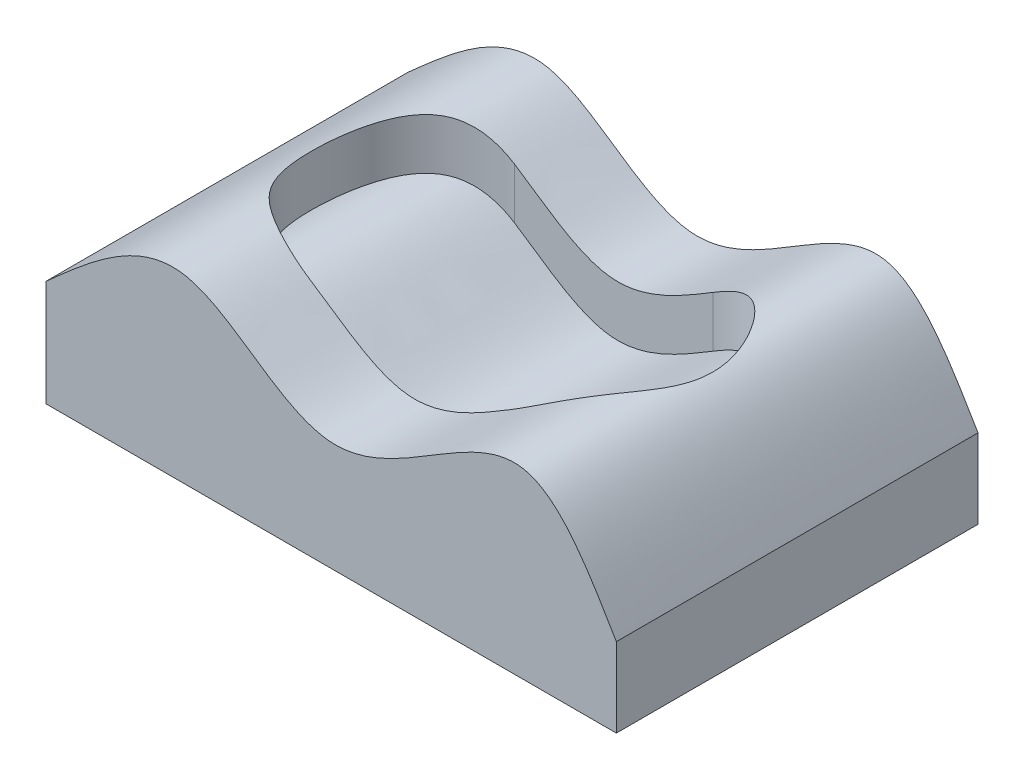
ISO-10303-21;
HEADER;
FILE_DESCRIPTION(('STEP AP214'),'2;1');
FILE_NAME('part.step','',(''),(''),'','','');
FILE_SCHEMA(('AUTOMOTIVE_DESIGN { 1 0 10303 214 1 1 1 1 }'));
ENDSEC;
DATA;
#1=APPLICATION_CONTEXT('core data for automotive mechanical design processes');
#2=APPLICATION_PROTOCOL_DEFINITION('international standard','automotive_design',2000,#1);
#3=PRODUCT_CONTEXT('',#1,'mechanical');
#4=PRODUCT('Part','Part','',(#3));
#5=PRODUCT_RELATED_PRODUCT_CATEGORY('part','',(#4));
#6=PRODUCT_DEFINITION_FORMATION('','',#4);
#7=PRODUCT_DEFINITION_CONTEXT('part definition',#1,'design');
#8=PRODUCT_DEFINITION('design','',#6,#7);
#9=PRODUCT_DEFINITION_SHAPE('','',#8);
#10=(LENGTH_UNIT() NAMED_UNIT(*) SI_UNIT(.MILLI.,.METRE.));
#11=(NAMED_UNIT(*) PLANE_ANGLE_UNIT() SI_UNIT($,.RADIAN.));
#12=(NAMED_UNIT(*) SI_UNIT($,.STERADIAN.) SOLID_ANGLE_UNIT());
#13=UNCERTAINTY_MEASURE_WITH_UNIT(LENGTH_MEASURE(1.E-05),#10,'distance_accuracy_value','');
#14=(GEOMETRIC_REPRESENTATION_CONTEXT(3) GLOBAL_UNCERTAINTY_ASSIGNED_CONTEXT((#13)) GLOBAL_UNIT_ASSIGNED_CONTEXT((#10,
#11,#12)) REPRESENTATION_CONTEXT('',''));
#15=CARTESIAN_POINT('',(0.,0.,0.));
#16=DIRECTION('',(0.,0.,1.));
#17=DIRECTION('',(1.,0.,0.));
#18=AXIS2_PLACEMENT_3D('',#15,#16,#17);
#19=CARTESIAN_POINT('',(55.9861591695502,0.,35.5));
#20=DIRECTION('',(-1.,0.,0.));
#21=DIRECTION('',(0.,0.,1.));
#22=AXIS2_PLACEMENT_3D('',#19,#20,#21);
#23=PLANE('',#22);
#24=DIRECTION('',(0.,1.,0.));
#25=VECTOR('',#24,1.);
#26=CARTESIAN_POINT('',(55.9861591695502,0.,-35.5));
#27=LINE('',#26,#25);
#28=CARTESIAN_POINT('',(55.9861591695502,0.,-35.5));
#29=VERTEX_POINT('',#28);
#30=CARTESIAN_POINT('',(55.9861591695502,15.5517108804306,-35.5));
#31=VERTEX_POINT('',#30);
#32=EDGE_CURVE('E119',#29,#31,#27,.T.);
#33=ORIENTED_EDGE('',*,*,#32,.T.);
#34=DIRECTION('',(0.,0.,-1.));
#35=VECTOR('',#34,1.);
#36=CARTESIAN_POINT('',(55.9861591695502,15.5517108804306,35.5));
#37=LINE('',#36,#35);
#38=CARTESIAN_POINT('',(55.9861591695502,15.5517108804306,35.5));
#39=VERTEX_POINT('',#38);
#40=EDGE_CURVE('E11',#39,#31,#37,.T.);
#41=ORIENTED_EDGE('',*,*,#40,.F.);
#42=DIRECTION('',(0.,1.,0.));
#43=VECTOR('',#42,1.);
#44=CARTESIAN_POINT('',(55.9861591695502,0.,35.5));
#45=LINE('',#44,#43);
#46=CARTESIAN_POINT('',(55.9861591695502,0.,35.5));
#47=VERTEX_POINT('',#46);
#48=EDGE_CURVE('E164',#47,#39,#45,.T.);
#49=ORIENTED_EDGE('',*,*,#48,.F.);
#50=DIRECTION('',(0.,0.,-1.));
#51=VECTOR('',#50,1.);
#52=CARTESIAN_POINT('',(55.9861591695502,0.,35.5));
#53=LINE('',#52,#51);
#54=EDGE_CURVE('E171',#47,#29,#53,.T.);
#55=ORIENTED_EDGE('',*,*,#54,.T.);
#56=EDGE_LOOP('',(#33,#41,#49,#55));
#57=FACE_BOUND('',#56,.T.);
#58=ADVANCED_FACE('F34',(#57),#23,.F.);
#59=CARTESIAN_POINT('',(55.9861591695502,15.5517108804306,35.5));
#60=CARTESIAN_POINT('',(50.3042531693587,25.2107971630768,35.5));
#61=CARTESIAN_POINT('',(36.3909910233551,48.8629659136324,35.5));
#62=CARTESIAN_POINT('',(1.40554862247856,7.26706724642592,35.5));
#63=CARTESIAN_POINT('',(-28.4752897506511,45.4255632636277,35.5));
#64=CARTESIAN_POINT('',(-46.9508395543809,28.9140942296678,35.5));
#65=CARTESIAN_POINT('',(-55.9861591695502,20.839292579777,35.5));
#66=B_SPLINE_CURVE_WITH_KNOTS('',3,(#59,#60,#61,#62,#63,#64,#65),.UNSPECIFIED.,.F.,.F.,(4,1,1,1,
4),(0.,0.211458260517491,0.517797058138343,0.76418251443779,1.),.UNSPECIFIED.);
#67=DIRECTION('',(0.,0.,-1.));
#68=VECTOR('',#67,1.);
#69=SURFACE_OF_LINEAR_EXTRUSION('',#66,#68);
#70=CARTESIAN_POINT('',(-19.467914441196,31.314818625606,-19.948603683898));
#71=CARTESIAN_POINT('',(-13.1813858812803,27.2886813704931,-19.948603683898));
#72=CARTESIAN_POINT('',(-0.78766788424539,16.8135515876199,-19.948603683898));
#73=CARTESIAN_POINT('',(13.0418750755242,25.0555855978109,-19.948603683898));
#74=CARTESIAN_POINT('',(19.4679144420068,28.9487308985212,-19.948603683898));
#75=B_SPLINE_CURVE_WITH_KNOTS('',3,(#70,#71,#72,#73,#74),.UNSPECIFIED.,.F.,.F.,(4,1,4),
(0.364379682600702,0.528159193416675,0.681576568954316),.UNSPECIFIED.);
#76=CARTESIAN_POINT('',(19.4679144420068,28.9487308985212,-19.948603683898));
#77=VERTEX_POINT('',#76);
#78=CARTESIAN_POINT('',(-19.4679144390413,31.314818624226,-19.948603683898));
#79=VERTEX_POINT('',#78);
#80=EDGE_CURVE('E109',#77,#79,#75,.F.);
#81=ORIENTED_EDGE('',*,*,#80,.F.);
#82=CARTESIAN_POINT('',(19.4679144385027,28.9487308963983,-19.948603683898));
#83=CARTESIAN_POINT('',(19.6837834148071,29.0795118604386,-19.9486025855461));
#84=CARTESIAN_POINT('',(19.8996219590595,29.2103505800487,-19.9452433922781));
#85=CARTESIAN_POINT('',(20.3298763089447,29.4710018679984,-19.9317204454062));
#86=CARTESIAN_POINT('',(20.5442926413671,29.600815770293,-19.9215989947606));
#87=CARTESIAN_POINT('',(20.971666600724,29.859088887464,-19.8945515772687));
#88=CARTESIAN_POINT('',(21.1846249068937,29.9875514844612,-19.8776688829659));
#89=CARTESIAN_POINT('',(21.6090443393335,30.2427973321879,-19.8370978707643));
#90=CARTESIAN_POINT('',(21.8205063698,30.3695860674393,-19.8134535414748));
#91=CARTESIAN_POINT('',(22.2419016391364,30.6211706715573,-19.759357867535));
#92=CARTESIAN_POINT('',(22.4518360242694,30.7459740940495,-19.7289509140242));
#93=CARTESIAN_POINT('',(22.7660532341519,30.931741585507,-19.6781561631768));
#94=CARTESIAN_POINT('',(22.8704296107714,30.9932791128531,-19.660409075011));
#95=CARTESIAN_POINT('',(23.0815012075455,31.117337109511,-19.6227340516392));
#96=CARTESIAN_POINT('',(23.1881948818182,31.1798478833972,-19.6027655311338));
#97=CARTESIAN_POINT('',(23.507804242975,31.3664456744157,-19.5401658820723));
#98=CARTESIAN_POINT('',(23.7206091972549,31.4898118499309,-19.4947825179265));
#99=CARTESIAN_POINT('',(24.1453827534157,31.7339730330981,-19.3967312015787));
#100=CARTESIAN_POINT('',(24.3573521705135,31.8547729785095,-19.344079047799));
#101=CARTESIAN_POINT('',(24.7804122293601,32.0934528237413,-19.2314926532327));
#102=CARTESIAN_POINT('',(24.99150378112,32.2113381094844,-19.1715732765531));
#103=CARTESIAN_POINT('',(25.4127563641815,32.4438338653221,-19.0444431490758));
#104=CARTESIAN_POINT('',(25.6229183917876,32.5584499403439,-18.977245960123));
#105=CARTESIAN_POINT('',(26.0422745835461,32.7840596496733,-18.8356002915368));
#106=CARTESIAN_POINT('',(26.2514697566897,32.8950587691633,-18.7611635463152));
#107=CARTESIAN_POINT('',(26.6742639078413,33.115911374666,-18.6028523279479));
#108=CARTESIAN_POINT('',(26.8878431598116,33.2256678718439,-18.5187893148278));
#109=CARTESIAN_POINT('',(27.3115616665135,33.4394439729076,-18.3434082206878));
#110=CARTESIAN_POINT('',(27.5217129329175,33.5435133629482,-18.2521800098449));
#111=CARTESIAN_POINT('',(27.9385754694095,33.7457029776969,-18.06251320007));
#112=CARTESIAN_POINT('',(28.1453000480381,33.8438726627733,-17.9641567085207));
#113=CARTESIAN_POINT('',(28.5552953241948,34.0340647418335,-17.7602341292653));
#114=CARTESIAN_POINT('',(28.7585803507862,34.1261346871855,-17.6547412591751));
#115=CARTESIAN_POINT('',(29.1616958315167,34.3039557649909,-17.4365463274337));
#116=CARTESIAN_POINT('',(29.3615408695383,34.3897506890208,-17.3239071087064));
#117=CARTESIAN_POINT('',(29.6591687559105,34.5137799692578,-17.149307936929));
#118=CARTESIAN_POINT('',(29.7577771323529,34.5542503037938,-17.0903228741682));
#119=CARTESIAN_POINT('',(29.9576252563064,34.6349735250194,-16.9683980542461));
#120=CARTESIAN_POINT('',(30.0588451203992,34.6751756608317,-16.9053920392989));
#121=CARTESIAN_POINT('',(30.3607169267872,34.7929779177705,-16.7136290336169));
#122=CARTESIAN_POINT('',(30.5603306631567,34.8680869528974,-16.581688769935));
#123=CARTESIAN_POINT('',(31.0050225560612,35.0288846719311,-16.276024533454));
#124=CARTESIAN_POINT('',(31.2492255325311,35.1126408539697,-16.0999973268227));
#125=CARTESIAN_POINT('',(31.6365479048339,35.2379089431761,-15.80745898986));
#126=CARTESIAN_POINT('',(31.7815039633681,35.2830419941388,-15.6948946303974));
#127=CARTESIAN_POINT('',(32.1144314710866,35.3825897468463,-15.4289455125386));
#128=CARTESIAN_POINT('',(32.3015434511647,35.4354395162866,-15.2738877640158));
#129=CARTESIAN_POINT('',(32.6686592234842,35.5329125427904,-14.957993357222));
#130=CARTESIAN_POINT('',(32.8487235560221,35.5776330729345,-14.7972569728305));
#131=CARTESIAN_POINT('',(33.2058607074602,35.660135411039,-14.4663771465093));
#132=CARTESIAN_POINT('',(33.3828707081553,35.6978264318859,-14.2961432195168));
#133=CARTESIAN_POINT('',(33.7304749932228,35.7655448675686,-13.9491557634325));
#134=CARTESIAN_POINT('',(33.9010918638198,35.7956019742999,-13.7724306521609));
#135=CARTESIAN_POINT('',(34.1941592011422,35.8418088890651,-13.4574429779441));
#136=CARTESIAN_POINT('',(34.3179511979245,35.8595558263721,-13.3206591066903));
#137=CARTESIAN_POINT('',(34.481657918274,35.8807134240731,-13.1347230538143));
#138=CARTESIAN_POINT('',(34.5231523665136,35.8858719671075,-13.0871481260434));
#139=CARTESIAN_POINT('',(34.7284720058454,35.9103908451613,-12.8494964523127));
#140=CARTESIAN_POINT('',(34.8891681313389,35.9263701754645,-12.6563316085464));
#141=CARTESIAN_POINT('',(35.2020003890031,35.9514029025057,-12.2654718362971));
#142=CARTESIAN_POINT('',(35.3541977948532,35.9605141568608,-12.06782953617));
#143=CARTESIAN_POINT('',(35.5764929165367,35.9695272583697,-11.7675563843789));
#144=CARTESIAN_POINT('',(35.6494227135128,35.9717561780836,-11.6670768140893));
#145=CARTESIAN_POINT('',(35.794769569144,35.9747848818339,-11.462849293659));
#146=CARTESIAN_POINT('',(35.8671508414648,35.9755568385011,-11.3590754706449));
#147=CARTESIAN_POINT('',(36.0804449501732,35.975719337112,-11.0470385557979));
#148=CARTESIAN_POINT('',(36.2184571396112,35.9729932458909,-10.8367779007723));
#149=CARTESIAN_POINT('',(36.4854657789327,35.9625875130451,-10.4126684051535));
#150=CARTESIAN_POINT('',(36.6145154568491,35.9549405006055,-10.198852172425));
#151=CARTESIAN_POINT('',(36.8637877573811,35.9355048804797,-9.76763895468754));
#152=CARTESIAN_POINT('',(36.9840483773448,35.9237355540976,-9.55026305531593));
#153=CARTESIAN_POINT('',(37.2159049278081,35.8968334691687,-9.11194044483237));
#154=CARTESIAN_POINT('',(37.3275245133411,35.8817103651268,-8.89100563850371));
#155=CARTESIAN_POINT('',(37.5422779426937,35.8489164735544,-8.44557725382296));
#156=CARTESIAN_POINT('',(37.6454220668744,35.831248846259,-8.22108839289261));
#157=CARTESIAN_POINT('',(37.8452520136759,35.7938610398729,-7.76423170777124));
#158=CARTESIAN_POINT('',(37.9417750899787,35.7741078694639,-7.53179541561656));
#159=CARTESIAN_POINT('',(38.1253183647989,35.7338485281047,-7.06506808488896));
#160=CARTESIAN_POINT('',(38.2123977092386,35.7133482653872,-6.8307997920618));
#161=CARTESIAN_POINT('',(38.3772206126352,35.6723788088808,-6.36041661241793));
#162=CARTESIAN_POINT('',(38.4550116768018,35.6519100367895,-6.12431833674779));
#163=CARTESIAN_POINT('',(38.6013983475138,35.6116914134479,-5.65028163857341));
#164=CARTESIAN_POINT('',(38.6700298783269,35.5919389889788,-5.41235452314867));
#165=CARTESIAN_POINT('',(38.7982172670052,35.5537530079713,-4.93465498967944));
#166=CARTESIAN_POINT('',(38.857797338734,35.5353160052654,-4.69488936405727));
#167=CARTESIAN_POINT('',(38.9404813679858,35.5090189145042,-4.33377735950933));
#168=CARTESIAN_POINT('',(38.9669149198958,35.5004841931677,-4.21323335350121));
#169=CARTESIAN_POINT('',(39.0177088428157,35.4838755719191,-3.97082248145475));
#170=CARTESIAN_POINT('',(39.0420539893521,35.4758051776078,-3.84895218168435));
#171=CARTESIAN_POINT('',(39.1116452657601,35.4524772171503,-3.48254242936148));
#172=CARTESIAN_POINT('',(39.1534297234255,35.4381085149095,-3.23728041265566));
#173=CARTESIAN_POINT('',(39.2278865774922,35.4120938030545,-2.7447978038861));
#174=CARTESIAN_POINT('',(39.260543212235,35.4004525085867,-2.49757457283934));
#175=CARTESIAN_POINT('',(39.2956613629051,35.3877926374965,-2.18773227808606));
#176=CARTESIAN_POINT('',(39.302408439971,35.3853521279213,-2.12563811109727));
#177=CARTESIAN_POINT('',(39.3283775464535,35.3759316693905,-1.87593026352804));
#178=CARTESIAN_POINT('',(39.3452796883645,35.3697361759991,-1.68803885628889));
#179=CARTESIAN_POINT('',(39.3784449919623,35.3575151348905,-1.25045650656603));
#180=CARTESIAN_POINT('',(39.3927027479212,35.3522037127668,-1.00059146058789));
#181=CARTESIAN_POINT('',(39.4116795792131,35.3451189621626,-0.501642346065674));
#182=CARTESIAN_POINT('',(39.4164437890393,35.3433288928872,-0.252560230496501));
#183=CARTESIAN_POINT('',(39.4165913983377,35.3432734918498,0.24408738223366));
#184=CARTESIAN_POINT('',(39.412031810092,35.3449867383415,0.491652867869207));
#185=CARTESIAN_POINT('',(39.3937439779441,35.3518156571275,0.986208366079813));
#186=CARTESIAN_POINT('',(39.3800227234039,35.3569287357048,1.23319867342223));
#187=CARTESIAN_POINT('',(39.3433671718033,35.3704453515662,1.72660365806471));
#188=CARTESIAN_POINT('',(39.3204255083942,35.3788515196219,1.97301771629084));
#189=CARTESIAN_POINT('',(39.2653166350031,35.3987436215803,2.46526921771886));
#190=CARTESIAN_POINT('',(39.2331279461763,35.4102367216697,2.71110395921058));
#191=CARTESIAN_POINT('',(39.159477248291,35.4360176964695,3.20220637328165));
#192=CARTESIAN_POINT('',(39.1179800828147,35.4503161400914,3.44746823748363));
#193=CARTESIAN_POINT('',(39.0488480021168,35.4735426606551,3.81441692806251));
#194=CARTESIAN_POINT('',(39.02460345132,35.4815983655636,3.93680808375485));
#195=CARTESIAN_POINT('',(38.9739571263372,35.4981987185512,4.18046671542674));
#196=CARTESIAN_POINT('',(38.9475667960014,35.5067407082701,4.30173674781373));
#197=CARTESIAN_POINT('',(38.8647796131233,35.5331366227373,4.66567834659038));
#198=CARTESIAN_POINT('',(38.8049469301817,35.5516989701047,4.90752322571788));
#199=CARTESIAN_POINT('',(38.6596190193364,35.5950971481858,5.45106971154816));
#200=CARTESIAN_POINT('',(38.5714916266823,35.6203121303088,5.75204123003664));
#201=CARTESIAN_POINT('',(38.4201402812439,35.6610103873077,6.22752441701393));
#202=CARTESIAN_POINT('',(38.3614335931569,35.6762650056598,6.40351093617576));
#203=CARTESIAN_POINT('',(38.2186486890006,35.7118415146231,6.8125124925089));
#204=CARTESIAN_POINT('',(38.132662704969,35.7321477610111,7.04486745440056));
#205=CARTESIAN_POINT('',(37.9517807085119,35.771995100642,7.50692608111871));
#206=CARTESIAN_POINT('',(37.8568596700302,35.7915338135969,7.7366201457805));
#207=CARTESIAN_POINT('',(37.6592583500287,35.8287951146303,8.19038858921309));
#208=CARTESIAN_POINT('',(37.5566534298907,35.8465321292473,8.41449458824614));
#209=CARTESIAN_POINT('',(37.3423722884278,35.8796076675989,8.86037908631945));
#210=CARTESIAN_POINT('',(37.2306397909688,35.8949292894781,9.08213185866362));
#211=CARTESIAN_POINT('',(37.0272657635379,35.9188482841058,9.46773497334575));
#212=CARTESIAN_POINT('',(36.9373958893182,35.9281737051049,9.63247943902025));
#213=CARTESIAN_POINT('',(36.6916863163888,35.9500286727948,10.0683398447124));
#214=CARTESIAN_POINT('',(36.5317514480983,35.9605595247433,10.3372712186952));
#215=CARTESIAN_POINT('',(36.2324006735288,35.9726140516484,10.8146631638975));
#216=CARTESIAN_POINT('',(36.095237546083,35.9755133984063,11.0245048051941));
#217=CARTESIAN_POINT('',(35.8834339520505,35.9756610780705,11.3354688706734));
#218=CARTESIAN_POINT('',(35.8117381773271,35.9750069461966,11.4386052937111));
#219=CARTESIAN_POINT('',(35.6677235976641,35.972238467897,11.6416700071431));
#220=CARTESIAN_POINT('',(35.5954386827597,35.9701503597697,11.7416227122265));
#221=CARTESIAN_POINT('',(35.3758419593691,35.9616303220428,12.039466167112));
#222=CARTESIAN_POINT('',(35.2258126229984,35.9529426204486,12.2353064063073));
#223=CARTESIAN_POINT('',(34.9184185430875,35.9290200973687,12.6214706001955));
#224=CARTESIAN_POINT('',(34.7610375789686,35.9137701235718,12.8117806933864));
#225=CARTESIAN_POINT('',(34.4388392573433,35.8762131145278,13.1869130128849));
#226=CARTESIAN_POINT('',(34.2739893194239,35.8538719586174,13.3717038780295));
#227=CARTESIAN_POINT('',(33.9367496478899,35.8016462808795,13.7358078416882));
#228=CARTESIAN_POINT('',(33.764312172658,35.7717057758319,13.9150686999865));
#229=CARTESIAN_POINT('',(33.4118110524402,35.7038276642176,14.2681507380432));
#230=CARTESIAN_POINT('',(33.2316868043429,35.6658102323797,14.4418960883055));
#231=CARTESIAN_POINT('',(32.8692680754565,35.5826315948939,14.7786981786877));
#232=CARTESIAN_POINT('',(32.6870664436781,35.5376067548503,14.9418886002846));
#233=CARTESIAN_POINT('',(32.3164528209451,35.4395763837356,15.2617634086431));
#234=CARTESIAN_POINT('',(32.1280026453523,35.3865095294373,15.4183848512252));
#235=CARTESIAN_POINT('',(31.7932326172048,35.2866460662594,15.6864244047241));
#236=CARTESIAN_POINT('',(31.6478094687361,35.2414619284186,15.7995744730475));
#237=CARTESIAN_POINT('',(31.2627113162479,35.1171392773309,16.0908285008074));
#238=CARTESIAN_POINT('',(31.0212240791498,35.0345038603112,16.2650767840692));
#239=CARTESIAN_POINT('',(30.5804061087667,34.87552316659,16.5685105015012));
#240=CARTESIAN_POINT('',(30.3819195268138,34.8010345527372,16.6999089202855));
#241=CARTESIAN_POINT('',(30.0814233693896,34.6840788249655,16.8912546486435));
#242=CARTESIAN_POINT('',(29.9804192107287,34.6440657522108,16.9542996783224));
#243=CARTESIAN_POINT('',(29.7796136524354,34.563160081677,17.0771518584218));
#244=CARTESIAN_POINT('',(29.6798237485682,34.5222966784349,17.1369970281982));
#245=CARTESIAN_POINT('',(29.3777638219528,34.3966700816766,17.3145529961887));
#246=CARTESIAN_POINT('',(29.1746138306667,34.3095763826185,17.4291328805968));
#247=CARTESIAN_POINT('',(28.7114521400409,34.1054402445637,17.6798601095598));
#248=CARTESIAN_POINT('',(28.4508562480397,33.986647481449,17.8135092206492));
#249=CARTESIAN_POINT('',(28.0349266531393,33.7913247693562,18.0156973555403));
#250=CARTESIAN_POINT('',(27.8803394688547,33.7174858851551,18.0884249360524));
#251=CARTESIAN_POINT('',(27.5179563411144,33.5416512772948,18.2533430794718));
#252=CARTESIAN_POINT('',(27.3098747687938,33.4385904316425,18.3437812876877));
#253=CARTESIAN_POINT('',(26.8915196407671,33.22752521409,18.5171813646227));
#254=CARTESIAN_POINT('',(26.6812403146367,33.1194972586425,18.6001004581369));
#255=CARTESIAN_POINT('',(26.2649832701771,32.9021719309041,18.7562369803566));
#256=CARTESIAN_POINT('',(26.0590258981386,32.7929699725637,18.8296418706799));
#257=CARTESIAN_POINT('',(25.6457493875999,32.5708254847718,18.9695159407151));
#258=CARTESIAN_POINT('',(25.4384280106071,32.4578710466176,19.0359595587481));
#259=CARTESIAN_POINT('',(25.0224502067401,32.2285329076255,19.1618687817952));
#260=CARTESIAN_POINT('',(24.8137917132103,32.1121376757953,19.2213065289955));
#261=CARTESIAN_POINT('',(24.3951829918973,31.876240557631,19.3332181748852));
#262=CARTESIAN_POINT('',(24.1852309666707,31.7567279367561,19.3856626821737));
#263=CARTESIAN_POINT('',(23.7640745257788,31.5149192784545,19.4835860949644));
#264=CARTESIAN_POINT('',(23.5528685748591,31.3926135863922,19.5290345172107));
#265=CARTESIAN_POINT('',(23.1292452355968,31.1455456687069,19.6129676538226));
#266=CARTESIAN_POINT('',(22.9168265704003,31.0207750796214,19.6514212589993));
#267=CARTESIAN_POINT('',(22.49081887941,30.7691071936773,19.721365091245));
#268=CARTESIAN_POINT('',(22.2772288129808,30.6422029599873,19.7528239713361));
#269=CARTESIAN_POINT('',(21.8489199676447,30.3866008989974,19.808778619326));
#270=CARTESIAN_POINT('',(21.63420035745,30.2578976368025,19.8332431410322));
#271=CARTESIAN_POINT('',(21.2036744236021,29.9990337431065,19.8752088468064));
#272=CARTESIAN_POINT('',(20.9878674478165,29.8688692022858,19.89267916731));
#273=CARTESIAN_POINT('',(20.5552096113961,29.6074228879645,19.9206562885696));
#274=CARTESIAN_POINT('',(20.3383582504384,29.4761387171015,19.9311328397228));
#275=CARTESIAN_POINT('',(19.9036536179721,29.2127945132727,19.9451208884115));
#276=CARTESIAN_POINT('',(19.6857999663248,29.0807335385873,19.9486029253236));
#277=CARTESIAN_POINT('',(19.4679144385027,28.9487308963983,19.948603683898));
#278=B_SPLINE_CURVE_WITH_KNOTS('',3,(#82,#83,#84,#85,#86,#87,#88,#89,#90,#91,#92,#93,#94,#95,
#96,#97,#98,#99,#100,#101,#102,#103,#104,#105,#106,#107,#108,#109,#110,#111,#112,#113,#114,#115,
#116,#117,#118,#119,#120,#121,#122,#123,#124,#125,#126,#127,#128,#129,#130,#131,#132,#133,#134,
#135,#136,#137,#138,#139,#140,#141,#142,#143,#144,#145,#146,#147,#148,#149,#150,#151,#152,#153,
#154,#155,#156,#157,#158,#159,#160,#161,#162,#163,#164,#165,#166,#167,#168,#169,#170,#171,#172,
#173,#174,#175,#176,#177,#178,#179,#180,#181,#182,#183,#184,#185,#186,#187,#188,#189,#190,#191,
#192,#193,#194,#195,#196,#197,#198,#199,#200,#201,#202,#203,#204,#205,#206,#207,#208,#209,#210,
#211,#212,#213,#214,#215,#216,#217,#218,#219,#220,#221,#222,#223,#224,#225,#226,#227,#228,#229,
#230,#231,#232,#233,#234,#235,#236,#237,#238,#239,#240,#241,#242,#243,#244,#245,#246,#247,#248,
#249,#250,#251,#252,#253,#254,#255,#256,#257,#258,#259,#260,#261,#262,#263,#264,#265,#266,#267,
#268,#269,#270,#271,#272,#273,#274,#275,#276,#277),.UNSPECIFIED.,.F.,.F.,(4,2,2,2,2,2,2,2,2,2,2,
2,2,2,2,2,2,2,2,2,2,2,2,2,2,2,2,2,2,2,2,2,2,2,2,2,2,2,2,2,2,2,2,2,2,2,2,2,2,2,2,2,2,2,2,2,2,2,2,
2,2,2,2,2,2,2,2,2,2,2,2,2,2,2,2,2,2,2,2,2,2,2,2,2,2,2,2,2,2,2,2,2,2,2,2,2,2,4),(0.,
0.7571673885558,1.5096419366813,2.25737563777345,3.00035141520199,3.73858701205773,
4.10595307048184,4.48171856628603,5.23197972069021,5.98063515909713,6.7277843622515,
7.47356449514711,8.21815534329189,8.9812465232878,9.73595268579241,10.4830382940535,
11.2233698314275,11.9579106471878,12.3233551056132,12.7007961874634,13.4529118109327,
14.3897565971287,14.9566539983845,15.7024293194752,16.4385900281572,17.1836840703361,
17.9258341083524,18.4817202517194,18.6717345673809,19.426753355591,20.1753384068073,
20.5478417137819,20.9273903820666,21.6817051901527,22.4310691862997,23.1769739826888,
23.9207587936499,24.6636276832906,25.420811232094,26.1729392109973,26.921038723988,
27.6661120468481,28.4091557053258,28.7802457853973,29.1538447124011,29.9012778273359,
30.6499937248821,30.8375148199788,31.4036828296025,32.154460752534,32.9016607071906,
33.6443054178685,34.3863842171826,35.1290570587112,35.8734691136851,36.6207414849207,
36.9958095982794,37.368994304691,38.1182925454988,39.0617710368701,39.6201532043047,
40.365726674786,41.1134543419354,41.8546234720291,42.6007684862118,43.1643838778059,
44.1031405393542,44.8550308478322,45.2318316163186,45.6019153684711,46.3422129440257,
47.0842291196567,47.8298712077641,48.5811743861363,49.3402802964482,50.0861281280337,
50.8379796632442,51.4070313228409,52.3336106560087,53.0816291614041,53.4584284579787,
53.8283807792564,54.5750551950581,55.5227482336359,56.0810337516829,56.8284354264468,
57.579852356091,58.312920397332,59.0485922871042,59.7870972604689,60.5286142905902,
61.2732759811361,62.0211726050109,62.7723562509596,63.5268450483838,64.2846274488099,
65.0456665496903,65.8099044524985),.UNSPECIFIED.);
#279=CARTESIAN_POINT('',(19.4679144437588,28.9487308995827,19.948603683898));
#280=VERTEX_POINT('',#279);
#281=EDGE_CURVE('E375',#77,#280,#278,.T.);
#282=ORIENTED_EDGE('',*,*,#281,.T.);
#283=CARTESIAN_POINT('',(19.4679144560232,28.9487309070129,19.948603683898));
#284=CARTESIAN_POINT('',(13.0418750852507,25.0555856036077,19.948603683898));
#285=CARTESIAN_POINT('',(-0.787667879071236,16.8135515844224,19.948603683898));
#286=CARTESIAN_POINT('',(-13.181385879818,27.2886813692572,19.948603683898));
#287=CARTESIAN_POINT('',(-19.4679144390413,31.314818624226,19.948603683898));
#288=B_SPLINE_CURVE_WITH_KNOTS('',3,(#283,#284,#285,#286,#287),.UNSPECIFIED.,.F.,.F.,(4,1,4),
(0.364379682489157,0.517797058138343,0.681576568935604),.UNSPECIFIED.);
#289=CARTESIAN_POINT('',(-19.4679144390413,31.314818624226,19.948603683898));
#290=VERTEX_POINT('',#289);
#291=EDGE_CURVE('E136',#280,#290,#288,.T.);
#292=ORIENTED_EDGE('',*,*,#291,.T.);
#293=CARTESIAN_POINT('',(-19.4679144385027,31.314818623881,19.948603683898));
#294=CARTESIAN_POINT('',(-19.7584700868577,31.5008838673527,19.9485978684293));
#295=CARTESIAN_POINT('',(-20.0503196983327,31.6850136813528,19.9423107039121));
#296=CARTESIAN_POINT('',(-20.63283976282,32.0454790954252,19.91680418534));
#297=CARTESIAN_POINT('',(-20.9234738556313,32.2218859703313,19.8977587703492));
#298=CARTESIAN_POINT('',(-21.503640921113,32.5657144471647,19.8467365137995));
#299=CARTESIAN_POINT('',(-21.7931364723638,32.7332247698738,19.8149363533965));
#300=CARTESIAN_POINT('',(-22.3710699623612,33.0580453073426,19.7383996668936));
#301=CARTESIAN_POINT('',(-22.6594719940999,33.2154604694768,19.6938382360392));
#302=CARTESIAN_POINT('',(-23.2543513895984,33.5289645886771,19.5884096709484));
#303=CARTESIAN_POINT('',(-23.5609733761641,33.6845364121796,19.5268005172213));
#304=CARTESIAN_POINT('',(-24.0202685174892,33.9072049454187,19.422998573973));
#305=CARTESIAN_POINT('',(-24.1720090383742,33.9790948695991,19.3868442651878));
#306=CARTESIAN_POINT('',(-24.4744878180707,34.1188465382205,19.3109632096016));
#307=CARTESIAN_POINT('',(-24.6252205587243,34.1867418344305,19.2712765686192));
#308=CARTESIAN_POINT('',(-24.9256859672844,34.3183917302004,19.1883340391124));
#309=CARTESIAN_POINT('',(-25.0754144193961,34.3821797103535,19.1451159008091));
#310=CARTESIAN_POINT('',(-25.3738793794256,34.5055126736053,19.0551125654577));
#311=CARTESIAN_POINT('',(-25.522612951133,34.5650901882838,19.0083622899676));
#312=CARTESIAN_POINT('',(-25.8190945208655,34.67990605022,18.911297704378));
#313=CARTESIAN_POINT('',(-25.9668408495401,34.7351753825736,18.8610150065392));
#314=CARTESIAN_POINT('',(-26.2613535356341,34.8412855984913,18.7568892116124));
#315=CARTESIAN_POINT('',(-26.4081193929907,34.8921551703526,18.7030739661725));
#316=CARTESIAN_POINT('',(-26.7100802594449,34.9925082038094,18.5883137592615));
#317=CARTESIAN_POINT('',(-26.865270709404,35.0417403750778,18.5271363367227));
#318=CARTESIAN_POINT('',(-27.1737461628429,35.1347550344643,18.4010158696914));
#319=CARTESIAN_POINT('',(-27.3270343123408,35.1785884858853,18.3361181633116));
#320=CARTESIAN_POINT('',(-27.6317113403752,35.2608032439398,18.2025633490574));
#321=CARTESIAN_POINT('',(-27.7831049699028,35.2992296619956,18.1339449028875));
#322=CARTESIAN_POINT('',(-28.0839986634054,35.3706381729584,17.992955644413));
#323=CARTESIAN_POINT('',(-28.233504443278,35.4036585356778,17.9206164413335));
#324=CARTESIAN_POINT('',(-28.5306277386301,35.464282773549,17.7721932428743));
#325=CARTESIAN_POINT('',(-28.6782511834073,35.4919171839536,17.6961336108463));
#326=CARTESIAN_POINT('',(-28.9716195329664,35.5417803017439,17.5402752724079));
#327=CARTESIAN_POINT('',(-29.1173697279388,35.5640312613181,17.4604936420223));
#328=CARTESIAN_POINT('',(-29.4069870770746,35.6033635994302,17.2972020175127));
#329=CARTESIAN_POINT('',(-29.5508580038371,35.6204576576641,17.213701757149));
#330=CARTESIAN_POINT('',(-29.8367157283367,35.6497656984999,17.0429802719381));
#331=CARTESIAN_POINT('',(-29.9787039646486,35.6619836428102,16.9557621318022));
#332=CARTESIAN_POINT('',(-30.2628196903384,35.6819452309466,16.7763373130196));
#333=CARTESIAN_POINT('',(-30.4049171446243,35.6896188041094,16.6840753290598));
#334=CARTESIAN_POINT('',(-30.6864586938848,35.7004592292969,16.4961455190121));
#335=CARTESIAN_POINT('',(-30.8259089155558,35.7036381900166,16.4004875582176));
#336=CARTESIAN_POINT('',(-31.1021571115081,35.7058123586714,16.2057705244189));
#337=CARTESIAN_POINT('',(-31.238958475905,35.7048133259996,16.1067163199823));
#338=CARTESIAN_POINT('',(-31.5099106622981,35.6989406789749,15.9052115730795));
#339=CARTESIAN_POINT('',(-31.6440619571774,35.6940677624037,15.8027616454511));
#340=CARTESIAN_POINT('',(-31.9097158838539,35.6807429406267,15.5944691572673));
#341=CARTESIAN_POINT('',(-32.0412160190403,35.6722878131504,15.488623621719));
#342=CARTESIAN_POINT('',(-32.3015692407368,35.6520812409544,15.2735434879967));
#343=CARTESIAN_POINT('',(-32.4304169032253,35.6403236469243,15.1643029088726));
#344=CARTESIAN_POINT('',(-32.6854679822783,35.613782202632,14.9424340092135));
#345=CARTESIAN_POINT('',(-32.811663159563,35.598990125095,14.8297972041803));
#346=CARTESIAN_POINT('',(-33.0614073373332,35.5666383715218,14.6011429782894));
#347=CARTESIAN_POINT('',(-33.1849454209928,35.5490691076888,14.48511502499));
#348=CARTESIAN_POINT('',(-33.5474544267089,35.493218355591,14.1359409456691));
#349=CARTESIAN_POINT('',(-33.7818781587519,35.4514070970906,13.8986043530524));
#350=CARTESIAN_POINT('',(-34.2379821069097,35.3604267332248,13.4130943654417));
#351=CARTESIAN_POINT('',(-34.4596541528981,35.3112529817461,13.164914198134));
#352=CARTESIAN_POINT('',(-34.8903000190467,35.2074354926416,12.6577177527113));
#353=CARTESIAN_POINT('',(-35.0992386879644,35.1527776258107,12.3986745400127));
#354=CARTESIAN_POINT('',(-35.5044327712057,35.0396924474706,11.8697722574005));
#355=CARTESIAN_POINT('',(-35.7006275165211,34.9812494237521,11.5998701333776));
#356=CARTESIAN_POINT('',(-36.0793354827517,34.8624335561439,11.0507371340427));
#357=CARTESIAN_POINT('',(-36.2618382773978,34.8020592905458,10.7714993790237));
#358=CARTESIAN_POINT('',(-36.6121824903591,34.6811762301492,10.2048891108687));
#359=CARTESIAN_POINT('',(-36.7800557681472,34.6206680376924,9.91753617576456));
#360=CARTESIAN_POINT('',(-37.1011406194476,34.5008843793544,9.33470174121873));
#361=CARTESIAN_POINT('',(-37.254359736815,34.4416082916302,9.03922452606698));
#362=CARTESIAN_POINT('',(-37.5462142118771,34.3254536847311,8.44018711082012));
#363=CARTESIAN_POINT('',(-37.6848298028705,34.268578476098,8.13661663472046));
#364=CARTESIAN_POINT('',(-37.9464462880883,34.1586993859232,7.52324684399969));
#365=CARTESIAN_POINT('',(-38.0694934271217,34.1056842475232,7.21346930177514));
#366=CARTESIAN_POINT('',(-38.2997864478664,34.0045612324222,6.58757507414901));
#367=CARTESIAN_POINT('',(-38.4070442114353,33.9564496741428,6.27146336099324));
#368=CARTESIAN_POINT('',(-38.6058481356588,33.865904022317,5.63294717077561));
#369=CARTESIAN_POINT('',(-38.6973678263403,33.8234795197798,5.31053308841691));
#370=CARTESIAN_POINT('',(-38.8647156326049,33.744967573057,4.65942285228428));
#371=CARTESIAN_POINT('',(-38.9404756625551,33.708907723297,4.33070587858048));
#372=CARTESIAN_POINT('',(-39.0759366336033,33.643839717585,3.66899336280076));
#373=CARTESIAN_POINT('',(-39.1356240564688,33.614837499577,3.33599446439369));
#374=CARTESIAN_POINT('',(-39.2377982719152,33.564871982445,2.66949540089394));
#375=CARTESIAN_POINT('',(-39.2804186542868,33.5438463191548,2.33602048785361));
#376=CARTESIAN_POINT('',(-39.3485202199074,33.5101242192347,1.66859263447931));
#377=CARTESIAN_POINT('',(-39.3740862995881,33.4973865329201,1.33465048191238));
#378=CARTESIAN_POINT('',(-39.4080619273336,33.4804383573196,0.6663041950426));
#379=CARTESIAN_POINT('',(-39.4165034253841,33.4762119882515,0.331902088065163));
#380=CARTESIAN_POINT('',(-39.4165326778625,33.4761973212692,-0.340858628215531));
#381=CARTESIAN_POINT('',(-39.4079197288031,33.4805095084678,-0.679217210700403));
#382=CARTESIAN_POINT('',(-39.3735675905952,33.497645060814,-1.35417585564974));
#383=CARTESIAN_POINT('',(-39.3478623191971,33.5104515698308,-1.69077807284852));
#384=CARTESIAN_POINT('',(-39.279314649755,33.5443913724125,-2.36221959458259));
#385=CARTESIAN_POINT('',(-39.2364516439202,33.5655346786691,-2.6970562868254));
#386=CARTESIAN_POINT('',(-39.1336643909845,33.6157915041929,-3.36497055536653));
#387=CARTESIAN_POINT('',(-39.0736675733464,33.6449389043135,-3.69803437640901));
#388=CARTESIAN_POINT('',(-38.9377023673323,33.710230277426,-4.35735226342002));
#389=CARTESIAN_POINT('',(-38.8618670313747,33.7463157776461,-4.68363961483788));
#390=CARTESIAN_POINT('',(-38.6940937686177,33.8250033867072,-5.33113236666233));
#391=CARTESIAN_POINT('',(-38.6021611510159,33.8676033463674,-5.65233940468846));
#392=CARTESIAN_POINT('',(-38.4022419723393,33.9586159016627,-6.2896806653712));
#393=CARTESIAN_POINT('',(-38.2942198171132,34.0070413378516,-6.6058018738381));
#394=CARTESIAN_POINT('',(-38.062167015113,34.1088634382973,-7.23298608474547));
#395=CARTESIAN_POINT('',(-37.9380647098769,34.1622820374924,-7.54401896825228));
#396=CARTESIAN_POINT('',(-37.675128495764,34.2725861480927,-8.15814975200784));
#397=CARTESIAN_POINT('',(-37.536334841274,34.3294620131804,-8.46126663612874));
#398=CARTESIAN_POINT('',(-37.2441160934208,34.4456033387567,-9.05937291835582));
#399=CARTESIAN_POINT('',(-37.0907109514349,34.5048654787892,-9.35437270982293));
#400=CARTESIAN_POINT('',(-36.7693053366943,34.6245821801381,-9.9362586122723));
#401=CARTESIAN_POINT('',(-36.6012976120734,34.6850373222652,-10.2231405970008));
#402=CARTESIAN_POINT('',(-36.2507195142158,34.8057833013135,-10.788806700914));
#403=CARTESIAN_POINT('',(-36.0681176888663,34.8660734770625,-11.0675714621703));
#404=CARTESIAN_POINT('',(-35.688108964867,34.9850484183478,-11.6174158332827));
#405=CARTESIAN_POINT('',(-35.4906293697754,35.0437230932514,-11.8884474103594));
#406=CARTESIAN_POINT('',(-35.0827532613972,35.1571874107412,-12.4194793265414));
#407=CARTESIAN_POINT('',(-34.8724187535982,35.2119933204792,-12.679523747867));
#408=CARTESIAN_POINT('',(-34.4388693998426,35.3159941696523,-13.1885936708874));
#409=CARTESIAN_POINT('',(-34.2156904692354,35.3652037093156,-13.4376467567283));
#410=CARTESIAN_POINT('',(-33.7564611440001,35.4561108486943,-13.9247747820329));
#411=CARTESIAN_POINT('',(-33.5204190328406,35.4978132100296,-14.1628566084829));
#412=CARTESIAN_POINT('',(-33.1561019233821,35.5532557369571,-14.5123731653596));
#413=CARTESIAN_POINT('',(-33.0324285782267,35.5706073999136,-14.6280667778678));
#414=CARTESIAN_POINT('',(-32.7824240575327,35.6025068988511,-14.8560526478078));
#415=CARTESIAN_POINT('',(-32.6561037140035,35.6170643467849,-14.9683554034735));
#416=CARTESIAN_POINT('',(-32.4008126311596,35.6431196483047,-15.1895565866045));
#417=CARTESIAN_POINT('',(-32.271850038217,35.6546257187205,-15.2984634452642));
#418=CARTESIAN_POINT('',(-32.0112772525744,35.6743125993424,-15.5128765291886));
#419=CARTESIAN_POINT('',(-31.8796723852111,35.6824995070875,-15.6183886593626));
#420=CARTESIAN_POINT('',(-31.6138193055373,35.6952715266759,-15.8260147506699));
#421=CARTESIAN_POINT('',(-31.4795734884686,35.6998597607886,-15.9281315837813));
#422=CARTESIAN_POINT('',(-31.2084425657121,35.7051470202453,-16.1289705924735));
#423=CARTESIAN_POINT('',(-31.0715568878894,35.7058451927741,-16.227692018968));
#424=CARTESIAN_POINT('',(-30.7951503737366,35.7030536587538,-16.4217439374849));
#425=CARTESIAN_POINT('',(-30.6556260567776,35.6995579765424,-16.5170693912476));
#426=CARTESIAN_POINT('',(-30.3739465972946,35.688068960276,-16.704334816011));
#427=CARTESIAN_POINT('',(-30.2317852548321,35.6800632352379,-16.7962647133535));
#428=CARTESIAN_POINT('',(-29.9485208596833,35.6594991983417,-16.9744231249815));
#429=CARTESIAN_POINT('',(-29.8074608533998,35.6470425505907,-17.0607317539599));
#430=CARTESIAN_POINT('',(-29.5234914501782,35.6173137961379,-17.2296888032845));
#431=CARTESIAN_POINT('',(-29.3805805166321,35.6000374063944,-17.3123338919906));
#432=CARTESIAN_POINT('',(-29.0929154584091,35.5604001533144,-17.4739695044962));
#433=CARTESIAN_POINT('',(-28.9481575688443,35.5380264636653,-17.5529501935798));
#434=CARTESIAN_POINT('',(-28.6568051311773,35.487996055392,-17.7072610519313));
#435=CARTESIAN_POINT('',(-28.5102053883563,35.4603172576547,-17.7825742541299));
#436=CARTESIAN_POINT('',(-28.2151607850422,35.399685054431,-17.9295587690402));
#437=CARTESIAN_POINT('',(-28.0667101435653,35.366701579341,-18.0012060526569));
#438=CARTESIAN_POINT('',(-27.7679581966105,35.2954480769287,-18.1408653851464));
#439=CARTESIAN_POINT('',(-27.6176513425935,35.2571405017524,-18.2088463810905));
#440=CARTESIAN_POINT('',(-27.3151794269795,35.175245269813,-18.3411800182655));
#441=CARTESIAN_POINT('',(-27.1630097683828,35.1316134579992,-18.4054947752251));
#442=CARTESIAN_POINT('',(-26.8568030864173,35.0390840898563,-18.5305027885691));
#443=CARTESIAN_POINT('',(-26.7027630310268,34.9901367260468,-18.5911516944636));
#444=CARTESIAN_POINT('',(-26.4022949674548,34.8901597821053,-18.7052311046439));
#445=CARTESIAN_POINT('',(-26.2558709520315,34.8393562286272,-18.7588708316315));
#446=CARTESIAN_POINT('',(-25.9620471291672,34.733400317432,-18.8626625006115));
#447=CARTESIAN_POINT('',(-25.814647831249,34.6782194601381,-18.9127867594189));
#448=CARTESIAN_POINT('',(-25.5188654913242,34.5636022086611,-19.0095513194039));
#449=CARTESIAN_POINT('',(-25.370484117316,34.5041350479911,-19.0561602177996));
#450=CARTESIAN_POINT('',(-25.0727288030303,34.3810438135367,-19.1458976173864));
#451=CARTESIAN_POINT('',(-24.9233577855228,34.317387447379,-19.1889914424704));
#452=CARTESIAN_POINT('',(-24.6236125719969,34.1860211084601,-19.2717021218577));
#453=CARTESIAN_POINT('',(-24.4732425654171,34.1182780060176,-19.3112815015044));
#454=CARTESIAN_POINT('',(-24.1714946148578,33.978850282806,-19.386964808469));
#455=CARTESIAN_POINT('',(-24.020122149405,33.9071323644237,-19.4230289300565));
#456=CARTESIAN_POINT('',(-23.5619526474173,33.6850144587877,-19.5265823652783));
#457=CARTESIAN_POINT('',(-23.2560836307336,33.5298448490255,-19.5880629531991));
#458=CARTESIAN_POINT('',(-22.6617442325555,33.2166887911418,-19.6934730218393));
#459=CARTESIAN_POINT('',(-22.3731383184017,33.0591874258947,-19.7380982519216));
#460=CARTESIAN_POINT('',(-21.7947954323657,32.734177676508,-19.8147447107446));
#461=CARTESIAN_POINT('',(-21.5050944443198,32.5665640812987,-19.8465904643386));
#462=CARTESIAN_POINT('',(-20.9245145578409,32.2225146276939,-19.8976859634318));
#463=CARTESIAN_POINT('',(-20.6336731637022,32.045989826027,-19.9167586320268));
#464=CARTESIAN_POINT('',(-20.0507364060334,31.6852765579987,-19.9423017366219));
#465=CARTESIAN_POINT('',(-19.7586774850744,31.5010166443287,-19.9485978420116));
#466=CARTESIAN_POINT('',(-19.4679144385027,31.314818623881,-19.948603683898));
#467=B_SPLINE_CURVE_WITH_KNOTS('',3,(#293,#294,#295,#296,#297,#298,#299,#300,#301,#302,#303,
#304,#305,#306,#307,#308,#309,#310,#311,#312,#313,#314,#315,#316,#317,#318,#319,#320,#321,#322,
#323,#324,#325,#326,#327,#328,#329,#330,#331,#332,#333,#334,#335,#336,#337,#338,#339,#340,#341,
#342,#343,#344,#345,#346,#347,#348,#349,#350,#351,#352,#353,#354,#355,#356,#357,#358,#359,#360,
#361,#362,#363,#364,#365,#366,#367,#368,#369,#370,#371,#372,#373,#374,#375,#376,#377,#378,#379,
#380,#381,#382,#383,#384,#385,#386,#387,#388,#389,#390,#391,#392,#393,#394,#395,#396,#397,#398,
#399,#400,#401,#402,#403,#404,#405,#406,#407,#408,#409,#410,#411,#412,#413,#414,#415,#416,#417,
#418,#419,#420,#421,#422,#423,#424,#425,#426,#427,#428,#429,#430,#431,#432,#433,#434,#435,#436,
#437,#438,#439,#440,#441,#442,#443,#444,#445,#446,#447,#448,#449,#450,#451,#452,#453,#454,#455,
#456,#457,#458,#459,#460,#461,#462,#463,#464,#465,#466),.UNSPECIFIED.,.F.,.F.,(4,2,2,2,2,2,2,2,
2,2,2,2,2,2,2,2,2,2,2,2,2,2,2,2,2,2,2,2,2,2,2,2,2,2,2,2,2,2,2,2,2,2,2,2,2,2,2,2,2,2,2,2,2,2,2,2,
2,2,2,2,2,2,2,2,2,2,2,2,2,2,2,2,2,2,2,2,2,2,2,2,2,2,2,2,2,2,4),(0.,1.03508022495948,
2.05632839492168,3.06389334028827,4.05824662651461,5.10555761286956,5.620764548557,
6.13072767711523,6.6358154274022,7.13643686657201,7.63304080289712,8.12611442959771,
8.64777080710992,9.16404770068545,9.67572316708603,10.1836032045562,10.6885142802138,
11.19130124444,11.6928416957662,12.1939738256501,12.7026443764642,13.209941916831,
13.716540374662,14.2230476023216,14.7300114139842,15.2379255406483,15.74723539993,
16.2583436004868,17.2663764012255,18.2750480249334,19.2863885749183,20.3022359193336,
21.3188491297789,22.3331899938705,23.3470058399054,24.3621767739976,25.3742576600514,
26.3855729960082,27.3985729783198,28.4158624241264,29.4340048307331,30.4440143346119,
31.4489577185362,32.452024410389,33.4669657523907,34.4798990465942,35.4940526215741,
36.5125670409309,37.5228467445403,38.5327938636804,39.5450093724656,40.5619016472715,
41.5760764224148,42.5888857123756,43.6022008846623,44.6177620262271,45.6386550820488,
46.6549624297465,47.6685543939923,48.6815011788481,49.192154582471,49.7010185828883,
50.2084980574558,50.7150409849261,51.2211439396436,51.727357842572,52.2342938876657,
52.7426295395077,53.2400273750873,53.7378686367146,54.2369767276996,54.7382090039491,
55.2423897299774,55.7503259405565,56.2628045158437,56.7805850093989,57.2725100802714,
57.7679527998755,58.2673963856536,58.7712860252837,59.2800275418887,59.7939865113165,
60.8387138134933,61.8337463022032,62.8420089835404,63.8639751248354,64.8997942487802),.UNSPECIFIED.);
#468=EDGE_CURVE('E126',#290,#79,#467,.T.);
#469=ORIENTED_EDGE('',*,*,#468,.T.);
#470=EDGE_LOOP('',(#81,#282,#292,#469));
#471=FACE_BOUND('',#470,.T.);
#472=CARTESIAN_POINT('',(55.9861591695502,15.5517108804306,-35.5));
#473=CARTESIAN_POINT('',(50.3042531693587,25.2107971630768,-35.5));
#474=CARTESIAN_POINT('',(36.3909910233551,48.8629659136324,-35.5));
#475=CARTESIAN_POINT('',(1.40554862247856,7.26706724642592,-35.5));
#476=CARTESIAN_POINT('',(-28.4752897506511,45.4255632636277,-35.5));
#477=CARTESIAN_POINT('',(-46.9508395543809,28.9140942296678,-35.5));
#478=CARTESIAN_POINT('',(-55.9861591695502,20.839292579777,-35.5));
#479=B_SPLINE_CURVE_WITH_KNOTS('',3,(#472,#473,#474,#475,#476,#477,#478),.UNSPECIFIED.,.F.,.F.,
(4,1,1,1,4),(0.,0.211458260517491,0.517797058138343,0.76418251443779,1.),.UNSPECIFIED.);
#480=CARTESIAN_POINT('',(-55.9861591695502,20.839292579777,-35.5));
#481=VERTEX_POINT('',#480);
#482=EDGE_CURVE('E174',#31,#481,#479,.T.);
#483=ORIENTED_EDGE('',*,*,#482,.T.);
#484=DIRECTION('',(0.,0.,-1.));
#485=VECTOR('',#484,1.);
#486=CARTESIAN_POINT('',(-55.9861591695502,20.839292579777,35.5));
#487=LINE('',#486,#485);
#488=CARTESIAN_POINT('',(-55.9861591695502,20.839292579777,35.5));
#489=VERTEX_POINT('',#488);
#490=EDGE_CURVE('E43',#489,#481,#487,.T.);
#491=ORIENTED_EDGE('',*,*,#490,.F.);
#492=EDGE_CURVE('E88',#39,#489,#66,.T.);
#493=ORIENTED_EDGE('',*,*,#492,.F.);
#494=ORIENTED_EDGE('',*,*,#40,.T.);
#495=EDGE_LOOP('',(#483,#491,#493,#494));
#496=FACE_BOUND('',#495,.T.);
#497=ADVANCED_FACE('F135',(#471,#496),#69,.F.);
#498=CARTESIAN_POINT('',(-55.9861591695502,20.839292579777,35.5));
#499=DIRECTION('',(1.,0.,0.));
#500=DIRECTION('',(0.,0.,-1.));
#501=AXIS2_PLACEMENT_3D('',#498,#499,#500);
#502=PLANE('',#501);
#503=DIRECTION('',(0.,-1.,0.));
#504=VECTOR('',#503,1.);
#505=CARTESIAN_POINT('',(-55.9861591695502,20.839292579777,-35.5));
#506=LINE('',#505,#504);
#507=CARTESIAN_POINT('',(-55.9861591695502,0.,-35.5));
#508=VERTEX_POINT('',#507);
#509=EDGE_CURVE('E178',#481,#508,#506,.T.);
#510=ORIENTED_EDGE('',*,*,#509,.T.);
#511=DIRECTION('',(0.,0.,-1.));
#512=VECTOR('',#511,1.);
#513=CARTESIAN_POINT('',(-55.9861591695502,0.,35.5));
#514=LINE('',#513,#512);
#515=CARTESIAN_POINT('',(-55.9861591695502,0.,35.5));
#516=VERTEX_POINT('',#515);
#517=EDGE_CURVE('E185',#516,#508,#514,.T.);
#518=ORIENTED_EDGE('',*,*,#517,.F.);
#519=DIRECTION('',(0.,-1.,0.));
#520=VECTOR('',#519,1.);
#521=CARTESIAN_POINT('',(-55.9861591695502,20.839292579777,35.5));
#522=LINE('',#521,#520);
#523=EDGE_CURVE('E163',#489,#516,#522,.T.);
#524=ORIENTED_EDGE('',*,*,#523,.F.);
#525=ORIENTED_EDGE('',*,*,#490,.T.);
#526=EDGE_LOOP('',(#510,#518,#524,#525));
#527=FACE_BOUND('',#526,.T.);
#528=ADVANCED_FACE('F154',(#527),#502,.F.);
#529=CARTESIAN_POINT('',(55.9861591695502,0.,35.5));
#530=DIRECTION('',(0.,1.,0.));
#531=DIRECTION('',(0.,0.,1.));
#532=AXIS2_PLACEMENT_3D('',#529,#530,#531);
#533=PLANE('',#532);
#534=DIRECTION('',(1.,0.,0.));
#535=VECTOR('',#534,1.);
#536=CARTESIAN_POINT('',(55.9861591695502,0.,-35.5));
#537=LINE('',#536,#535);
#538=EDGE_CURVE('E81',#508,#29,#537,.T.);
#539=ORIENTED_EDGE('',*,*,#538,.T.);
#540=ORIENTED_EDGE('',*,*,#54,.F.);
#541=DIRECTION('',(1.,0.,0.));
#542=VECTOR('',#541,1.);
#543=CARTESIAN_POINT('',(55.9861591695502,0.,35.5));
#544=LINE('',#543,#542);
#545=EDGE_CURVE('E60',#516,#47,#544,.T.);
#546=ORIENTED_EDGE('',*,*,#545,.F.);
#547=ORIENTED_EDGE('',*,*,#517,.T.);
#548=EDGE_LOOP('',(#539,#540,#546,#547));
#549=FACE_BOUND('',#548,.T.);
#550=ADVANCED_FACE('F198',(#549),#533,.F.);
#551=CARTESIAN_POINT('',(2.22354720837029,21.49466741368,35.5));
#552=DIRECTION('',(0.,0.,-1.));
#553=DIRECTION('',(-1.,0.,0.));
#554=AXIS2_PLACEMENT_3D('',#551,#552,#553);
#555=PLANE('',#554);
#556=ORIENTED_EDGE('',*,*,#48,.T.);
#557=ORIENTED_EDGE('',*,*,#492,.T.);
#558=ORIENTED_EDGE('',*,*,#523,.T.);
#559=ORIENTED_EDGE('',*,*,#545,.T.);
#560=EDGE_LOOP('',(#556,#557,#558,#559));
#561=FACE_BOUND('',#560,.T.);
#562=ADVANCED_FACE('F200',(#561),#555,.F.);
#563=CARTESIAN_POINT('',(2.22354720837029,21.49466741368,-35.5));
#564=DIRECTION('',(0.,0.,-1.));
#565=DIRECTION('',(-1.,0.,0.));
#566=AXIS2_PLACEMENT_3D('',#563,#564,#565);
#567=PLANE('',#566);
#568=ORIENTED_EDGE('',*,*,#32,.F.);
#569=ORIENTED_EDGE('',*,*,#538,.F.);
#570=ORIENTED_EDGE('',*,*,#509,.F.);
#571=ORIENTED_EDGE('',*,*,#482,.F.);
#572=EDGE_LOOP('',(#568,#569,#570,#571));
#573=FACE_BOUND('',#572,.T.);
#574=ADVANCED_FACE('F194',(#573),#567,.T.);
#575=CARTESIAN_POINT('',(55.9861591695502,5.55171088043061,35.5));
#576=CARTESIAN_POINT('',(50.3042531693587,15.2107971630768,35.5));
#577=CARTESIAN_POINT('',(36.3909910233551,38.8629659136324,35.5));
#578=CARTESIAN_POINT('',(1.40554862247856,-2.73293275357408,35.5));
#579=CARTESIAN_POINT('',(-28.4752897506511,35.4255632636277,35.5));
#580=CARTESIAN_POINT('',(-46.9508395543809,18.9140942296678,35.5));
#581=CARTESIAN_POINT('',(-55.9861591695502,10.839292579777,35.5));
#582=B_SPLINE_CURVE_WITH_KNOTS('',3,(#575,#576,#577,#578,#579,#580,#581),.UNSPECIFIED.,.F.,.F.,
(4,1,1,1,4),(0.,0.211458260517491,0.517797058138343,0.76418251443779,1.),.UNSPECIFIED.);
#583=DIRECTION('',(0.,0.,-1.));
#584=VECTOR('',#583,1.);
#585=SURFACE_OF_LINEAR_EXTRUSION('',#582,#584);
#586=CARTESIAN_POINT('',(19.4679144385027,18.9487308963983,-19.948603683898));
#587=CARTESIAN_POINT('',(21.8265531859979,20.3776862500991,-19.948603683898));
#588=CARTESIAN_POINT('',(24.1448244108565,21.7946999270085,-19.5497497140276));
#589=CARTESIAN_POINT('',(27.6199339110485,23.609856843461,-18.2488690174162));
#590=CARTESIAN_POINT('',(28.7514835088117,24.1478483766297,-17.7042469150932));
#591=CARTESIAN_POINT('',(30.9632833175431,25.0411186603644,-16.3548619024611));
#592=CARTESIAN_POINT('',(32.0433719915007,25.3916372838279,-15.5435795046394));
#593=CARTESIAN_POINT('',(34.0105547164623,25.8459792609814,-13.7206636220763));
#594=CARTESIAN_POINT('',(34.9238414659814,25.9566723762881,-12.6868455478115));
#595=CARTESIAN_POINT('',(36.5199760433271,25.9898608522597,-10.4436069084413));
#596=CARTESIAN_POINT('',(37.1937368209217,25.9157690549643,-9.25376097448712));
#597=CARTESIAN_POINT('',(38.2956100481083,25.7095891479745,-6.73459347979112));
#598=CARTESIAN_POINT('',(38.71248330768,25.5836800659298,-5.42713111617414));
#599=CARTESIAN_POINT('',(39.2720787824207,25.4006998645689,-2.75721920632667));
#600=CARTESIAN_POINT('',(39.4162857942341,25.3433881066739,-1.37087070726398));
#601=CARTESIAN_POINT('',(39.4167498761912,25.3432140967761,1.36410077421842));
#602=CARTESIAN_POINT('',(39.2778791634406,25.3985852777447,2.71819633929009));
#603=CARTESIAN_POINT('',(38.7203685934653,25.5813143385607,5.40058355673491));
#604=CARTESIAN_POINT('',(38.3010624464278,25.7077791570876,6.71656772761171));
#605=CARTESIAN_POINT('',(37.2141009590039,25.9127297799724,9.21263316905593));
#606=CARTESIAN_POINT('',(36.5341885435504,25.9889007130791,10.4200849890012));
#607=CARTESIAN_POINT('',(34.9438360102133,25.9583170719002,12.6622168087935));
#608=CARTESIAN_POINT('',(34.0454324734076,25.8525882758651,13.6855589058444));
#609=CARTESIAN_POINT('',(32.0519182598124,25.3950263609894,15.5383848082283));
#610=CARTESIAN_POINT('',(30.9835632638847,25.0482425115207,16.340543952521));
#611=CARTESIAN_POINT('',(28.7744466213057,24.1581682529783,17.6921452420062));
#612=CARTESIAN_POINT('',(27.619109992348,23.6091529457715,18.248544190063));
#613=CARTESIAN_POINT('',(24.1734630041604,21.8102026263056,19.5402881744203));
#614=CARTESIAN_POINT('',(21.8275117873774,20.3782670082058,19.948603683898));
#615=CARTESIAN_POINT('',(19.4679144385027,18.9487308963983,19.948603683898));
#616=B_SPLINE_CURVE_WITH_KNOTS('',3,(#586,#587,#588,#589,#590,#591,#592,#593,#594,#595,#596,
#597,#598,#599,#600,#601,#602,#603,#604,#605,#606,#607,#608,#609,#610,#611,#612,#613,#614,#615),
.UNSPECIFIED.,.F.,.F.,(4,2,2,2,2,2,2,2,2,2,2,2,2,2,4),(0.,0.125,0.1875,0.25,0.3125,0.375,0.4375,
0.5,0.5625,0.625,0.6875,0.75,0.8125,0.875,1.),.UNSPECIFIED.);
#617=CARTESIAN_POINT('',(19.4679144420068,18.9487308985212,-19.948603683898));
#618=VERTEX_POINT('',#617);
#619=CARTESIAN_POINT('',(19.4679144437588,18.9487308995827,19.948603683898));
#620=VERTEX_POINT('',#619);
#621=EDGE_CURVE('E350',#618,#620,#616,.T.);
#622=ORIENTED_EDGE('',*,*,#621,.F.);
#623=CARTESIAN_POINT('',(19.4679144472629,18.9487309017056,-19.948603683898));
#624=CARTESIAN_POINT('',(13.0418750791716,15.0555855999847,-19.948603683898));
#625=CARTESIAN_POINT('',(-0.787667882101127,6.81355158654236,-19.948603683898));
#626=CARTESIAN_POINT('',(-13.1813858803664,17.2886813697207,-19.948603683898));
#627=CARTESIAN_POINT('',(-19.4679144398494,21.3148186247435,-19.948603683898));
#628=B_SPLINE_CURVE_WITH_KNOTS('',3,(#623,#624,#625,#626,#627),.UNSPECIFIED.,.F.,.F.,(4,1,4),
(0.364379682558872,0.517797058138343,0.681576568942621),.UNSPECIFIED.);
#629=CARTESIAN_POINT('',(-19.4679144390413,21.314818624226,-19.948603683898));
#630=VERTEX_POINT('',#629);
#631=EDGE_CURVE('E120',#618,#630,#628,.T.);
#632=ORIENTED_EDGE('',*,*,#631,.T.);
#633=CARTESIAN_POINT('',(-19.4679144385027,21.314818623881,19.948603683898));
#634=CARTESIAN_POINT('',(-20.6142835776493,22.048997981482,19.948603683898));
#635=CARTESIAN_POINT('',(-21.7687448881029,22.7460877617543,19.851763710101));
#636=CARTESIAN_POINT('',(-24.1315308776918,23.9911976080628,19.4328851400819));
#637=CARTESIAN_POINT('',(-25.35159578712,24.5410952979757,19.1046675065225));
#638=CARTESIAN_POINT('',(-27.7597305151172,25.3412837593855,18.1893323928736));
#639=CARTESIAN_POINT('',(-28.9808710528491,25.5919275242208,17.5859752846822));
#640=CARTESIAN_POINT('',(-31.2596724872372,25.7519324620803,16.1467430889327));
#641=CARTESIAN_POINT('',(-32.3382319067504,25.6795461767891,15.3007253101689));
#642=CARTESIAN_POINT('',(-34.2763840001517,25.3808879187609,13.4337818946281));
#643=CARTESIAN_POINT('',(-35.1344771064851,25.1588903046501,12.4208855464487));
#644=CARTESIAN_POINT('',(-36.6462143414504,24.6845641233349,10.2286654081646));
#645=CARTESIAN_POINT('',(-37.2950893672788,24.432275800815,9.04991855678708));
#646=CARTESIAN_POINT('',(-38.8580945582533,23.775794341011,5.38677226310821));
#647=CARTESIAN_POINT('',(-39.4168264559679,23.4760504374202,2.68410271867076));
#648=CARTESIAN_POINT('',(-39.4163637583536,23.476281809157,-1.3454872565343));
#649=CARTESIAN_POINT('',(-39.2766758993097,23.5474526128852,-2.7134808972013));
#650=CARTESIAN_POINT('',(-38.7342983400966,23.8079065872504,-5.34382452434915));
#651=CARTESIAN_POINT('',(-38.3348719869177,23.9958201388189,-6.61721833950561));
#652=CARTESIAN_POINT('',(-37.2779176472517,24.4392173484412,-9.08589298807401));
#653=CARTESIAN_POINT('',(-36.633109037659,24.6891712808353,-10.2500032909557));
#654=CARTESIAN_POINT('',(-35.1247751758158,25.1614316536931,-12.4325856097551));
#655=CARTESIAN_POINT('',(-34.2478578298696,25.3870904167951,-13.4649406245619));
#656=CARTESIAN_POINT('',(-32.3091441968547,25.6821671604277,-15.3249525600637));
#657=CARTESIAN_POINT('',(-31.2379147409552,25.7531005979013,-16.1634530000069));
#658=CARTESIAN_POINT('',(-28.9393669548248,25.5862422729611,-17.6091370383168));
#659=CARTESIAN_POINT('',(-27.7570644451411,25.3408927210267,-18.1908144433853));
#660=CARTESIAN_POINT('',(-25.3415808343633,24.5372700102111,-19.1080030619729));
#661=CARTESIAN_POINT('',(-24.1285935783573,23.9895436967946,-19.4332767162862));
#662=CARTESIAN_POINT('',(-21.7758599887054,22.7499430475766,-19.8506312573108));
#663=CARTESIAN_POINT('',(-20.6131380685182,22.0482643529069,-19.948603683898));
#664=CARTESIAN_POINT('',(-19.4679144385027,21.314818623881,-19.948603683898));
#665=B_SPLINE_CURVE_WITH_KNOTS('',3,(#633,#634,#635,#636,#637,#638,#639,#640,#641,#642,#643,
#644,#645,#646,#647,#648,#649,#650,#651,#652,#653,#654,#655,#656,#657,#658,#659,#660,#661,#662,
#663,#664),.UNSPECIFIED.,.F.,.F.,(4,2,2,2,2,2,2,2,2,2,2,2,2,2,2,4),(0.,0.0625,0.125,0.1875,0.25,
0.3125,0.375,0.5,0.5625,0.625,0.6875,0.75,0.8125,0.875,0.9375,1.),.UNSPECIFIED.);
#666=CARTESIAN_POINT('',(-19.4679144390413,21.314818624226,19.948603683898));
#667=VERTEX_POINT('',#666);
#668=EDGE_CURVE('E130',#667,#630,#665,.T.);
#669=ORIENTED_EDGE('',*,*,#668,.F.);
#670=CARTESIAN_POINT('',(-19.4679144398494,21.3148186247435,19.948603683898));
#671=CARTESIAN_POINT('',(-13.1813858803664,17.2886813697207,19.948603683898));
#672=CARTESIAN_POINT('',(-0.787667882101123,6.81355158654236,19.948603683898));
#673=CARTESIAN_POINT('',(13.0418750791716,15.0555855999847,19.948603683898));
#674=CARTESIAN_POINT('',(19.467914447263,18.9487309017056,19.948603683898));
#675=B_SPLINE_CURVE_WITH_KNOTS('',3,(#670,#671,#672,#673,#674),.UNSPECIFIED.,.F.,.F.,(4,1,4),
(0.364379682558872,0.528159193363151,0.681576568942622),.UNSPECIFIED.);
#676=EDGE_CURVE('E382',#620,#667,#675,.F.);
#677=ORIENTED_EDGE('',*,*,#676,.F.);
#678=EDGE_LOOP('',(#622,#632,#669,#677));
#679=FACE_BOUND('',#678,.T.);
#680=ADVANCED_FACE('F237',(#679),#585,.F.);
#681=CARTESIAN_POINT('',(19.4679144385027,28.9487308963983,-19.948603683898));
#682=CARTESIAN_POINT('',(21.8265531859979,30.3776862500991,-19.948603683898));
#683=CARTESIAN_POINT('',(24.1448244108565,31.7946999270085,-19.5497497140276));
#684=CARTESIAN_POINT('',(27.6199339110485,33.609856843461,-18.2488690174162));
#685=CARTESIAN_POINT('',(28.7514835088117,34.1478483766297,-17.7042469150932));
#686=CARTESIAN_POINT('',(30.9632833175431,35.0411186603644,-16.3548619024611));
#687=CARTESIAN_POINT('',(32.0433719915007,35.3916372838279,-15.5435795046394));
#688=CARTESIAN_POINT('',(34.0105547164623,35.8459792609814,-13.7206636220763));
#689=CARTESIAN_POINT('',(34.9238414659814,35.9566723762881,-12.6868455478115));
#690=CARTESIAN_POINT('',(36.5199760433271,35.9898608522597,-10.4436069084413));
#691=CARTESIAN_POINT('',(37.1937368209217,35.9157690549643,-9.25376097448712));
#692=CARTESIAN_POINT('',(38.2956100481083,35.7095891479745,-6.73459347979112));
#693=CARTESIAN_POINT('',(38.71248330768,35.5836800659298,-5.42713111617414));
#694=CARTESIAN_POINT('',(39.2720787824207,35.4006998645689,-2.75721920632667));
#695=CARTESIAN_POINT('',(39.4162857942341,35.3433881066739,-1.37087070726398));
#696=CARTESIAN_POINT('',(39.4167498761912,35.3432140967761,1.36410077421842));
#697=CARTESIAN_POINT('',(39.2778791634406,35.3985852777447,2.71819633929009));
#698=CARTESIAN_POINT('',(38.7203685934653,35.5813143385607,5.40058355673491));
#699=CARTESIAN_POINT('',(38.3010624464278,35.7077791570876,6.71656772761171));
#700=CARTESIAN_POINT('',(37.2141009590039,35.9127297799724,9.21263316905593));
#701=CARTESIAN_POINT('',(36.5341885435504,35.9889007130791,10.4200849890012));
#702=CARTESIAN_POINT('',(34.9438360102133,35.9583170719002,12.6622168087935));
#703=CARTESIAN_POINT('',(34.0454324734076,35.8525882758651,13.6855589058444));
#704=CARTESIAN_POINT('',(32.0519182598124,35.3950263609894,15.5383848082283));
#705=CARTESIAN_POINT('',(30.9835632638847,35.0482425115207,16.340543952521));
#706=CARTESIAN_POINT('',(28.7744466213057,34.1581682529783,17.6921452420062));
#707=CARTESIAN_POINT('',(27.619109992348,33.6091529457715,18.248544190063));
#708=CARTESIAN_POINT('',(24.1734630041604,31.8102026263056,19.5402881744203));
#709=CARTESIAN_POINT('',(21.8275117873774,30.3782670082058,19.948603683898));
#710=CARTESIAN_POINT('',(19.4679144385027,28.9487308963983,19.948603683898));
#711=B_SPLINE_CURVE_WITH_KNOTS('',3,(#681,#682,#683,#684,#685,#686,#687,#688,#689,#690,#691,
#692,#693,#694,#695,#696,#697,#698,#699,#700,#701,#702,#703,#704,#705,#706,#707,#708,#709,#710),
.UNSPECIFIED.,.F.,.F.,(4,2,2,2,2,2,2,2,2,2,2,2,2,2,4),(0.,0.125,0.1875,0.25,0.3125,0.375,0.4375,
0.5,0.5625,0.625,0.6875,0.75,0.8125,0.875,1.),.UNSPECIFIED.);
#712=DIRECTION('',(0.,-1.,0.));
#713=VECTOR('',#712,1.);
#714=SURFACE_OF_LINEAR_EXTRUSION('',#711,#713);
#715=ORIENTED_EDGE('',*,*,#621,.T.);
#716=DIRECTION('',(0.,-1.,0.));
#717=VECTOR('',#716,1.);
#718=CARTESIAN_POINT('',(19.467914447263,28.9487309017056,19.948603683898));
#719=LINE('',#718,#717);
#720=EDGE_CURVE('E378',#280,#620,#719,.T.);
#721=ORIENTED_EDGE('',*,*,#720,.F.);
#722=ORIENTED_EDGE('',*,*,#281,.F.);
#723=DIRECTION('',(0.,-1.,0.));
#724=VECTOR('',#723,1.);
#725=CARTESIAN_POINT('',(19.4679144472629,28.9487309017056,-19.948603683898));
#726=LINE('',#725,#724);
#727=EDGE_CURVE('E51',#77,#618,#726,.T.);
#728=ORIENTED_EDGE('',*,*,#727,.T.);
#729=EDGE_LOOP('',(#715,#721,#722,#728));
#730=FACE_BOUND('',#729,.T.);
#731=ADVANCED_FACE('F245',(#730),#714,.F.);
#732=CARTESIAN_POINT('',(-19.4679144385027,31.314818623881,19.948603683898));
#733=DIRECTION('',(0.,0.,1.));
#734=DIRECTION('',(0.,-1.,0.));
#735=AXIS2_PLACEMENT_3D('',#732,#733,#734);
#736=PLANE('',#735);
#737=ORIENTED_EDGE('',*,*,#676,.T.);
#738=DIRECTION('',(0.,-1.,0.));
#739=VECTOR('',#738,1.);
#740=CARTESIAN_POINT('',(-19.4679144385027,31.314818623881,19.948603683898));
#741=LINE('',#740,#739);
#742=EDGE_CURVE('E307',#290,#667,#741,.T.);
#743=ORIENTED_EDGE('',*,*,#742,.F.);
#744=ORIENTED_EDGE('',*,*,#291,.F.);
#745=ORIENTED_EDGE('',*,*,#720,.T.);
#746=EDGE_LOOP('',(#737,#743,#744,#745));
#747=FACE_BOUND('',#746,.T.);
#748=ADVANCED_FACE('F252',(#747),#736,.F.);
#749=CARTESIAN_POINT('',(-19.4679144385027,31.314818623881,19.948603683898));
#750=CARTESIAN_POINT('',(-20.6142835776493,32.048997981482,19.948603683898));
#751=CARTESIAN_POINT('',(-21.7687448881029,32.7460877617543,19.851763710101));
#752=CARTESIAN_POINT('',(-24.1315308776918,33.9911976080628,19.4328851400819));
#753=CARTESIAN_POINT('',(-25.35159578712,34.5410952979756,19.1046675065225));
#754=CARTESIAN_POINT('',(-27.7597305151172,35.3412837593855,18.1893323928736));
#755=CARTESIAN_POINT('',(-28.9808710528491,35.5919275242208,17.5859752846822));
#756=CARTESIAN_POINT('',(-31.2596724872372,35.7519324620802,16.1467430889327));
#757=CARTESIAN_POINT('',(-32.3382319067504,35.6795461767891,15.3007253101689));
#758=CARTESIAN_POINT('',(-34.2763840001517,35.3808879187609,13.4337818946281));
#759=CARTESIAN_POINT('',(-35.1344771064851,35.1588903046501,12.4208855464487));
#760=CARTESIAN_POINT('',(-36.6462143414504,34.6845641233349,10.2286654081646));
#761=CARTESIAN_POINT('',(-37.2950893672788,34.432275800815,9.04991855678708));
#762=CARTESIAN_POINT('',(-38.8580945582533,33.775794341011,5.38677226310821));
#763=CARTESIAN_POINT('',(-39.4168264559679,33.4760504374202,2.68410271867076));
#764=CARTESIAN_POINT('',(-39.4163637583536,33.476281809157,-1.3454872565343));
#765=CARTESIAN_POINT('',(-39.2766758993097,33.5474526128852,-2.7134808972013));
#766=CARTESIAN_POINT('',(-38.7342983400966,33.8079065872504,-5.34382452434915));
#767=CARTESIAN_POINT('',(-38.3348719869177,33.9958201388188,-6.61721833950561));
#768=CARTESIAN_POINT('',(-37.2779176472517,34.4392173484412,-9.08589298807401));
#769=CARTESIAN_POINT('',(-36.633109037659,34.6891712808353,-10.2500032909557));
#770=CARTESIAN_POINT('',(-35.1247751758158,35.1614316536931,-12.4325856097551));
#771=CARTESIAN_POINT('',(-34.2478578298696,35.3870904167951,-13.4649406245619));
#772=CARTESIAN_POINT('',(-32.3091441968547,35.6821671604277,-15.3249525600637));
#773=CARTESIAN_POINT('',(-31.2379147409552,35.7531005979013,-16.1634530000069));
#774=CARTESIAN_POINT('',(-28.9393669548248,35.5862422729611,-17.6091370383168));
#775=CARTESIAN_POINT('',(-27.7570644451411,35.3408927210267,-18.1908144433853));
#776=CARTESIAN_POINT('',(-25.3415808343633,34.5372700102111,-19.1080030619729));
#777=CARTESIAN_POINT('',(-24.1285935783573,33.9895436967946,-19.4332767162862));
#778=CARTESIAN_POINT('',(-21.7758599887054,32.7499430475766,-19.8506312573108));
#779=CARTESIAN_POINT('',(-20.6131380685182,32.0482643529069,-19.948603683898));
#780=CARTESIAN_POINT('',(-19.4679144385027,31.314818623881,-19.948603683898));
#781=B_SPLINE_CURVE_WITH_KNOTS('',3,(#749,#750,#751,#752,#753,#754,#755,#756,#757,#758,#759,
#760,#761,#762,#763,#764,#765,#766,#767,#768,#769,#770,#771,#772,#773,#774,#775,#776,#777,#778,
#779,#780),.UNSPECIFIED.,.F.,.F.,(4,2,2,2,2,2,2,2,2,2,2,2,2,2,2,4),(0.,0.0625,0.125,0.1875,0.25,
0.3125,0.375,0.5,0.5625,0.625,0.6875,0.75,0.8125,0.875,0.9375,1.),.UNSPECIFIED.);
#782=DIRECTION('',(0.,-1.,0.));
#783=VECTOR('',#782,1.);
#784=SURFACE_OF_LINEAR_EXTRUSION('',#781,#783);
#785=ORIENTED_EDGE('',*,*,#668,.T.);
#786=DIRECTION('',(0.,-1.,0.));
#787=VECTOR('',#786,1.);
#788=CARTESIAN_POINT('',(-19.4679144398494,31.3148186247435,-19.948603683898));
#789=LINE('',#788,#787);
#790=EDGE_CURVE('E113',#79,#630,#789,.T.);
#791=ORIENTED_EDGE('',*,*,#790,.F.);
#792=ORIENTED_EDGE('',*,*,#468,.F.);
#793=ORIENTED_EDGE('',*,*,#742,.T.);
#794=EDGE_LOOP('',(#785,#791,#792,#793));
#795=FACE_BOUND('',#794,.T.);
#796=ADVANCED_FACE('F124',(#795),#784,.F.);
#797=CARTESIAN_POINT('',(-19.4679144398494,31.3148186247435,-19.948603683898));
#798=DIRECTION('',(0.,0.,1.));
#799=DIRECTION('',(0.,-1.,0.));
#800=AXIS2_PLACEMENT_3D('',#797,#798,#799);
#801=PLANE('',#800);
#802=ORIENTED_EDGE('',*,*,#631,.F.);
#803=ORIENTED_EDGE('',*,*,#727,.F.);
#804=ORIENTED_EDGE('',*,*,#80,.T.);
#805=ORIENTED_EDGE('',*,*,#790,.T.);
#806=EDGE_LOOP('',(#802,#803,#804,#805));
#807=FACE_BOUND('',#806,.T.);
#808=ADVANCED_FACE('F112',(#807),#801,.T.);
#809=CLOSED_SHELL('',(#58,#497,#528,#550,#562,#574,#680,#731,#748,#796,#808));
#810=MANIFOLD_SOLID_BREP('B2',#809);
#811=ADVANCED_BREP_SHAPE_REPRESENTATION('',(#18,#810),#14);
#812=SHAPE_DEFINITION_REPRESENTATION(#9,#811);
ENDSEC;
END-ISO-10303-21;
